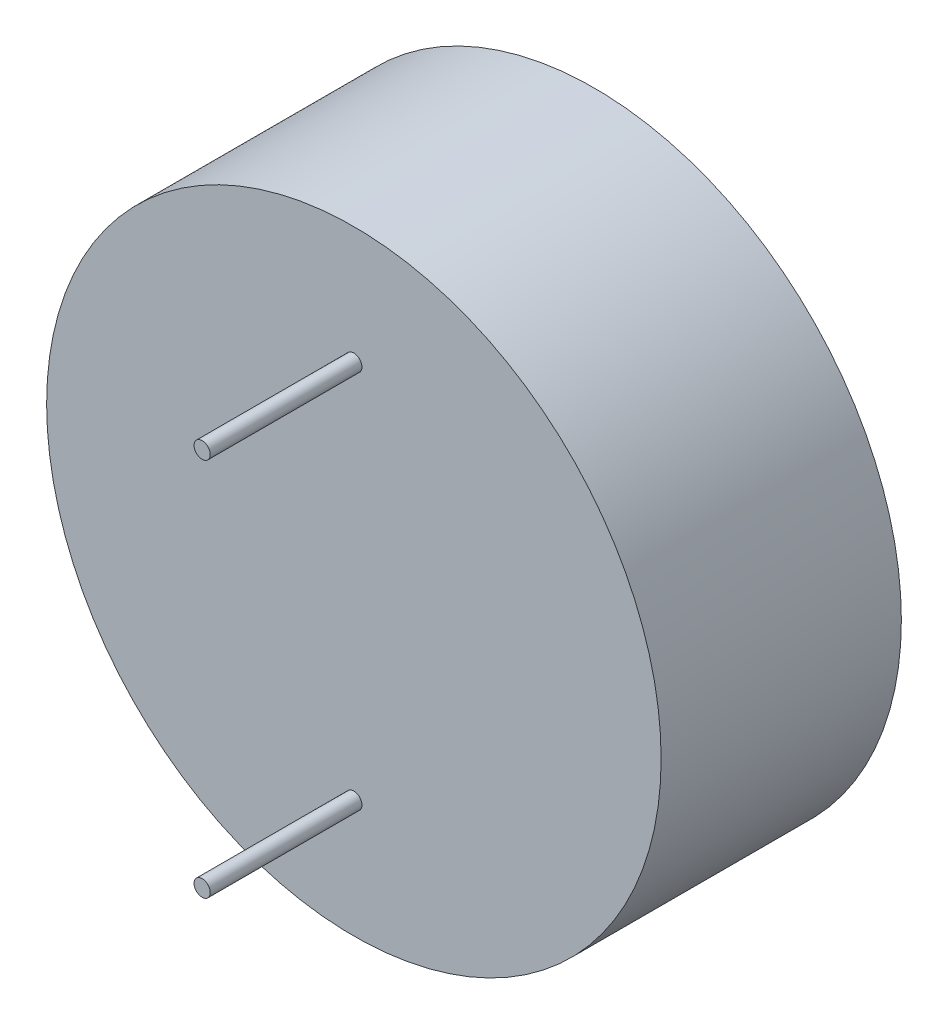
ISO-10303-21;
HEADER;
FILE_DESCRIPTION(('STEP AP214'),'2;1');
FILE_NAME('part.step','',(''),(''),'','','');
FILE_SCHEMA(('AUTOMOTIVE_DESIGN { 1 0 10303 214 1 1 1 1 }'));
ENDSEC;
DATA;
#1=APPLICATION_CONTEXT('core data for automotive mechanical design processes');
#2=APPLICATION_PROTOCOL_DEFINITION('international standard','automotive_design',2000,#1);
#3=PRODUCT_CONTEXT('',#1,'mechanical');
#4=PRODUCT('Part','Part','',(#3));
#5=PRODUCT_RELATED_PRODUCT_CATEGORY('part','',(#4));
#6=PRODUCT_DEFINITION_FORMATION('','',#4);
#7=PRODUCT_DEFINITION_CONTEXT('part definition',#1,'design');
#8=PRODUCT_DEFINITION('design','',#6,#7);
#9=PRODUCT_DEFINITION_SHAPE('','',#8);
#10=(LENGTH_UNIT() NAMED_UNIT(*) SI_UNIT(.MILLI.,.METRE.));
#11=(NAMED_UNIT(*) PLANE_ANGLE_UNIT() SI_UNIT($,.RADIAN.));
#12=(NAMED_UNIT(*) SI_UNIT($,.STERADIAN.) SOLID_ANGLE_UNIT());
#13=UNCERTAINTY_MEASURE_WITH_UNIT(LENGTH_MEASURE(1.E-05),#10,'distance_accuracy_value','');
#14=(GEOMETRIC_REPRESENTATION_CONTEXT(3) GLOBAL_UNCERTAINTY_ASSIGNED_CONTEXT((#13)) GLOBAL_UNIT_ASSIGNED_CONTEXT((#10,
#11,#12)) REPRESENTATION_CONTEXT('',''));
#15=CARTESIAN_POINT('',(0.,0.,0.));
#16=DIRECTION('',(0.,0.,1.));
#17=DIRECTION('',(1.,0.,0.));
#18=AXIS2_PLACEMENT_3D('',#15,#16,#17);
#19=CARTESIAN_POINT('',(0.,0.,9.5));
#20=DIRECTION('',(0.,0.,1.));
#21=DIRECTION('',(1.,0.,0.));
#22=AXIS2_PLACEMENT_3D('',#19,#20,#21);
#23=PLANE('',#22);
#24=CARTESIAN_POINT('',(0.,7.5,9.5));
#25=DIRECTION('',(0.,0.,1.));
#26=DIRECTION('',(1.,0.,0.));
#27=AXIS2_PLACEMENT_3D('',#24,#25,#26);
#28=CIRCLE('',#27,0.32);
#29=CARTESIAN_POINT('',(0.32,7.5,9.5));
#30=VERTEX_POINT('',#29);
#31=EDGE_CURVE('E54',#30,#30,#28,.T.);
#32=ORIENTED_EDGE('',*,*,#31,.F.);
#33=EDGE_LOOP('',(#32));
#34=FACE_BOUND('',#33,.T.);
#35=CARTESIAN_POINT('',(0.,0.,9.5));
#36=DIRECTION('',(0.,0.,1.));
#37=DIRECTION('',(1.,0.,0.));
#38=AXIS2_PLACEMENT_3D('',#35,#36,#37);
#39=CIRCLE('',#38,12.15);
#40=CARTESIAN_POINT('',(12.15,0.,9.5));
#41=VERTEX_POINT('',#40);
#42=EDGE_CURVE('E10',#41,#41,#39,.T.);
#43=ORIENTED_EDGE('',*,*,#42,.T.);
#44=EDGE_LOOP('',(#43));
#45=FACE_BOUND('',#44,.T.);
#46=CARTESIAN_POINT('',(0.,-7.5,9.5));
#47=DIRECTION('',(0.,0.,1.));
#48=DIRECTION('',(1.,0.,0.));
#49=AXIS2_PLACEMENT_3D('',#46,#47,#48);
#50=CIRCLE('',#49,0.32);
#51=CARTESIAN_POINT('',(0.32,-7.5,9.5));
#52=VERTEX_POINT('',#51);
#53=EDGE_CURVE('E60',#52,#52,#50,.T.);
#54=ORIENTED_EDGE('',*,*,#53,.F.);
#55=EDGE_LOOP('',(#54));
#56=FACE_BOUND('',#55,.T.);
#57=ADVANCED_FACE('F31',(#34,#45,#56),#23,.T.);
#58=CARTESIAN_POINT('',(0.,0.,9.5));
#59=DIRECTION('',(0.,0.,-1.));
#60=DIRECTION('',(-1.,0.,0.));
#61=AXIS2_PLACEMENT_3D('',#58,#59,#60);
#62=CYLINDRICAL_SURFACE('',#61,12.15);
#63=ORIENTED_EDGE('',*,*,#42,.F.);
#64=EDGE_LOOP('',(#63));
#65=FACE_BOUND('',#64,.T.);
#66=CARTESIAN_POINT('',(0.,0.,0.));
#67=DIRECTION('',(0.,0.,1.));
#68=DIRECTION('',(1.,0.,0.));
#69=AXIS2_PLACEMENT_3D('',#66,#67,#68);
#70=CIRCLE('',#69,12.15);
#71=CARTESIAN_POINT('',(12.15,0.,0.));
#72=VERTEX_POINT('',#71);
#73=EDGE_CURVE('E38',#72,#72,#70,.T.);
#74=ORIENTED_EDGE('',*,*,#73,.T.);
#75=EDGE_LOOP('',(#74));
#76=FACE_BOUND('',#75,.T.);
#77=ADVANCED_FACE('F33',(#65,#76),#62,.T.);
#78=CARTESIAN_POINT('',(0.,0.,0.));
#79=DIRECTION('',(0.,0.,1.));
#80=DIRECTION('',(1.,0.,0.));
#81=AXIS2_PLACEMENT_3D('',#78,#79,#80);
#82=PLANE('',#81);
#83=CARTESIAN_POINT('',(0.,0.,0.));
#84=DIRECTION('',(0.,0.,-1.));
#85=DIRECTION('',(-1.,0.,0.));
#86=AXIS2_PLACEMENT_3D('',#83,#84,#85);
#87=CIRCLE('',#86,1.75);
#88=CARTESIAN_POINT('',(-1.75,0.,0.));
#89=VERTEX_POINT('',#88);
#90=EDGE_CURVE('E46',#89,#89,#87,.T.);
#91=ORIENTED_EDGE('',*,*,#90,.F.);
#92=EDGE_LOOP('',(#91));
#93=FACE_BOUND('',#92,.T.);
#94=ORIENTED_EDGE('',*,*,#73,.F.);
#95=EDGE_LOOP('',(#94));
#96=FACE_BOUND('',#95,.T.);
#97=ADVANCED_FACE('F73',(#93,#96),#82,.F.);
#98=CARTESIAN_POINT('',(0.,0.,4.));
#99=DIRECTION('',(0.,0.,-1.));
#100=DIRECTION('',(-1.,0.,0.));
#101=AXIS2_PLACEMENT_3D('',#98,#99,#100);
#102=CYLINDRICAL_SURFACE('',#101,1.75);
#103=CARTESIAN_POINT('',(0.,0.,4.));
#104=DIRECTION('',(0.,0.,-1.));
#105=DIRECTION('',(-1.,0.,0.));
#106=AXIS2_PLACEMENT_3D('',#103,#104,#105);
#107=CIRCLE('',#106,1.75);
#108=CARTESIAN_POINT('',(-1.75,0.,4.));
#109=VERTEX_POINT('',#108);
#110=EDGE_CURVE('E42',#109,#109,#107,.T.);
#111=ORIENTED_EDGE('',*,*,#110,.F.);
#112=EDGE_LOOP('',(#111));
#113=FACE_BOUND('',#112,.T.);
#114=ORIENTED_EDGE('',*,*,#90,.T.);
#115=EDGE_LOOP('',(#114));
#116=FACE_BOUND('',#115,.T.);
#117=ADVANCED_FACE('F79',(#113,#116),#102,.F.);
#118=CARTESIAN_POINT('',(0.,0.,4.));
#119=DIRECTION('',(0.,0.,-1.));
#120=DIRECTION('',(-1.,0.,0.));
#121=AXIS2_PLACEMENT_3D('',#118,#119,#120);
#122=PLANE('',#121);
#123=ORIENTED_EDGE('',*,*,#110,.T.);
#124=EDGE_LOOP('',(#123));
#125=FACE_BOUND('',#124,.T.);
#126=ADVANCED_FACE('F83',(#125),#122,.T.);
#127=CARTESIAN_POINT('',(0.,7.5,15.5));
#128=DIRECTION('',(0.,0.,-1.));
#129=DIRECTION('',(-1.,0.,0.));
#130=AXIS2_PLACEMENT_3D('',#127,#128,#129);
#131=CYLINDRICAL_SURFACE('',#130,0.32);
#132=CARTESIAN_POINT('',(0.,7.5,15.5));
#133=DIRECTION('',(0.,0.,1.));
#134=DIRECTION('',(1.,0.,0.));
#135=AXIS2_PLACEMENT_3D('',#132,#133,#134);
#136=CIRCLE('',#135,0.32);
#137=CARTESIAN_POINT('',(0.32,7.5,15.5));
#138=VERTEX_POINT('',#137);
#139=EDGE_CURVE('E51',#138,#138,#136,.T.);
#140=ORIENTED_EDGE('',*,*,#139,.F.);
#141=EDGE_LOOP('',(#140));
#142=FACE_BOUND('',#141,.T.);
#143=ORIENTED_EDGE('',*,*,#31,.T.);
#144=EDGE_LOOP('',(#143));
#145=FACE_BOUND('',#144,.T.);
#146=ADVANCED_FACE('F86',(#142,#145),#131,.T.);
#147=CARTESIAN_POINT('',(0.,7.5,15.5));
#148=DIRECTION('',(0.,0.,1.));
#149=DIRECTION('',(1.,0.,0.));
#150=AXIS2_PLACEMENT_3D('',#147,#148,#149);
#151=PLANE('',#150);
#152=ORIENTED_EDGE('',*,*,#139,.T.);
#153=EDGE_LOOP('',(#152));
#154=FACE_BOUND('',#153,.T.);
#155=ADVANCED_FACE('F89',(#154),#151,.T.);
#156=CARTESIAN_POINT('',(0.,-7.5,15.5));
#157=DIRECTION('',(0.,0.,-1.));
#158=DIRECTION('',(-1.,0.,0.));
#159=AXIS2_PLACEMENT_3D('',#156,#157,#158);
#160=CYLINDRICAL_SURFACE('',#159,0.32);
#161=CARTESIAN_POINT('',(0.,-7.5,15.5));
#162=DIRECTION('',(0.,0.,1.));
#163=DIRECTION('',(1.,0.,0.));
#164=AXIS2_PLACEMENT_3D('',#161,#162,#163);
#165=CIRCLE('',#164,0.32);
#166=CARTESIAN_POINT('',(0.32,-7.5,15.5));
#167=VERTEX_POINT('',#166);
#168=EDGE_CURVE('E57',#167,#167,#165,.T.);
#169=ORIENTED_EDGE('',*,*,#168,.F.);
#170=EDGE_LOOP('',(#169));
#171=FACE_BOUND('',#170,.T.);
#172=ORIENTED_EDGE('',*,*,#53,.T.);
#173=EDGE_LOOP('',(#172));
#174=FACE_BOUND('',#173,.T.);
#175=ADVANCED_FACE('F64',(#171,#174),#160,.T.);
#176=CARTESIAN_POINT('',(0.,-7.5,15.5));
#177=DIRECTION('',(0.,0.,1.));
#178=DIRECTION('',(1.,0.,0.));
#179=AXIS2_PLACEMENT_3D('',#176,#177,#178);
#180=PLANE('',#179);
#181=ORIENTED_EDGE('',*,*,#168,.T.);
#182=EDGE_LOOP('',(#181));
#183=FACE_BOUND('',#182,.T.);
#184=ADVANCED_FACE('F96',(#183),#180,.T.);
#185=CLOSED_SHELL('',(#57,#77,#97,#117,#126,#146,#155,#175,#184));
#186=MANIFOLD_SOLID_BREP('B2',#185);
#187=ADVANCED_BREP_SHAPE_REPRESENTATION('',(#18,#186),#14);
#188=SHAPE_DEFINITION_REPRESENTATION(#9,#187);
ENDSEC;
END-ISO-10303-21;
